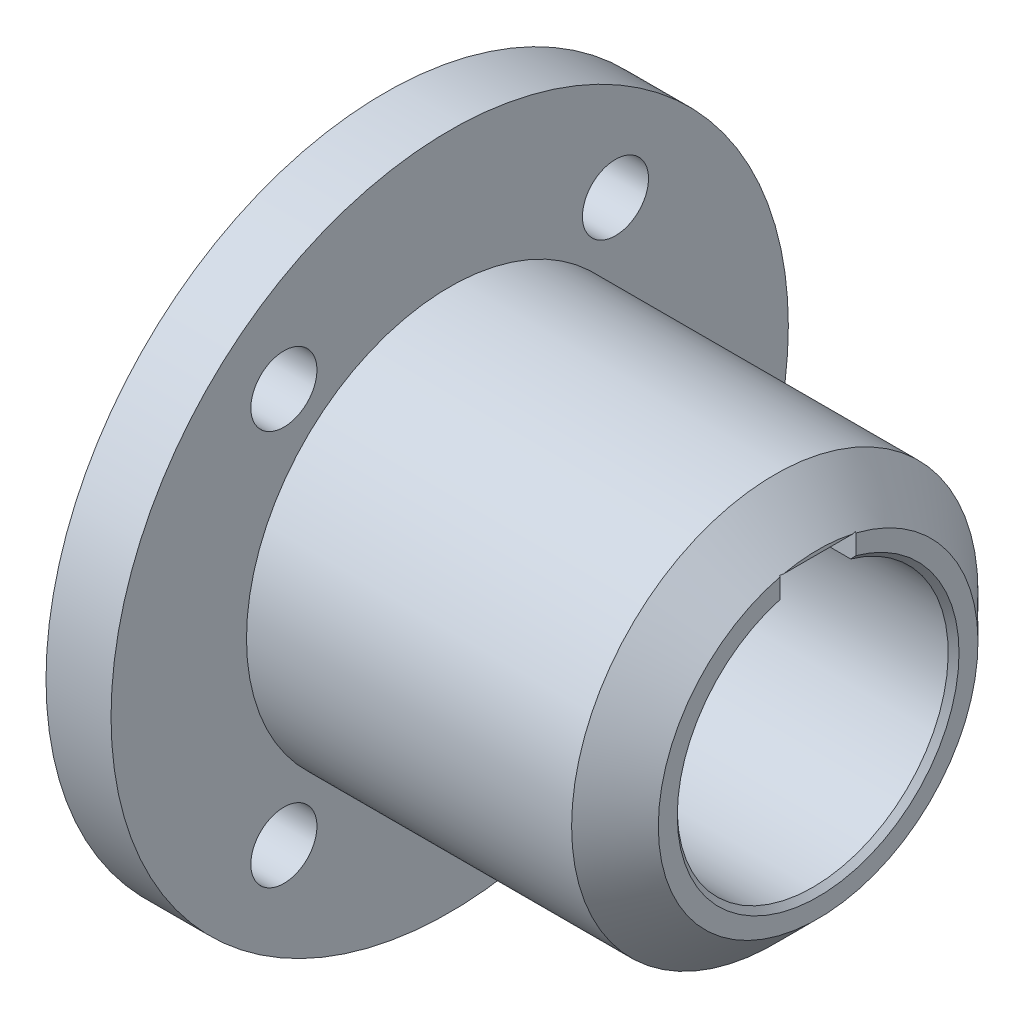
ISO-10303-21;
HEADER;
FILE_DESCRIPTION(('STEP AP214'),'2;1');
FILE_NAME('part.step','',(''),(''),'','','');
FILE_SCHEMA(('AUTOMOTIVE_DESIGN { 1 0 10303 214 1 1 1 1 }'));
ENDSEC;
DATA;
#1=APPLICATION_CONTEXT('core data for automotive mechanical design processes');
#2=APPLICATION_PROTOCOL_DEFINITION('international standard','automotive_design',2000,#1);
#3=PRODUCT_CONTEXT('',#1,'mechanical');
#4=PRODUCT('Part','Part','',(#3));
#5=PRODUCT_RELATED_PRODUCT_CATEGORY('part','',(#4));
#6=PRODUCT_DEFINITION_FORMATION('','',#4);
#7=PRODUCT_DEFINITION_CONTEXT('part definition',#1,'design');
#8=PRODUCT_DEFINITION('design','',#6,#7);
#9=PRODUCT_DEFINITION_SHAPE('','',#8);
#10=(LENGTH_UNIT() NAMED_UNIT(*) SI_UNIT(.MILLI.,.METRE.));
#11=(NAMED_UNIT(*) PLANE_ANGLE_UNIT() SI_UNIT($,.RADIAN.));
#12=(NAMED_UNIT(*) SI_UNIT($,.STERADIAN.) SOLID_ANGLE_UNIT());
#13=UNCERTAINTY_MEASURE_WITH_UNIT(LENGTH_MEASURE(1.E-05),#10,'distance_accuracy_value','');
#14=(GEOMETRIC_REPRESENTATION_CONTEXT(3) GLOBAL_UNCERTAINTY_ASSIGNED_CONTEXT((#13)) GLOBAL_UNIT_ASSIGNED_CONTEXT((#10,
#11,#12)) REPRESENTATION_CONTEXT('',''));
#15=CARTESIAN_POINT('',(0.,0.,0.));
#16=DIRECTION('',(0.,0.,1.));
#17=DIRECTION('',(1.,0.,0.));
#18=AXIS2_PLACEMENT_3D('',#15,#16,#17);
#19=CARTESIAN_POINT('',(0.,34.925,0.));
#20=DIRECTION('',(1.,0.,0.));
#21=DIRECTION('',(0.,0.,-1.));
#22=AXIS2_PLACEMENT_3D('',#19,#20,#21);
#23=PLANE('',#22);
#24=CARTESIAN_POINT('',(0.,36.4637154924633,-30.5966902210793));
#25=DIRECTION('',(1.,0.,0.));
#26=DIRECTION('',(0.,0.,-1.));
#27=AXIS2_PLACEMENT_3D('',#24,#25,#26);
#28=CIRCLE('',#27,6.1);
#29=CARTESIAN_POINT('',(0.,36.4637154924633,-36.6966902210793));
#30=VERTEX_POINT('',#29);
#31=EDGE_CURVE('E150',#30,#30,#28,.T.);
#32=ORIENTED_EDGE('',*,*,#31,.T.);
#33=EDGE_LOOP('',(#32));
#34=FACE_BOUND('',#33,.T.);
#35=CARTESIAN_POINT('',(0.,-36.4637154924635,30.5966902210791));
#36=DIRECTION('',(-1.,0.,0.));
#37=DIRECTION('',(0.,0.,1.));
#38=AXIS2_PLACEMENT_3D('',#35,#36,#37);
#39=CIRCLE('',#38,6.1);
#40=CARTESIAN_POINT('',(0.,-36.4637154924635,36.6966902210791));
#41=VERTEX_POINT('',#40);
#42=EDGE_CURVE('E147',#41,#41,#39,.T.);
#43=ORIENTED_EDGE('',*,*,#42,.F.);
#44=EDGE_LOOP('',(#43));
#45=FACE_BOUND('',#44,.T.);
#46=CARTESIAN_POINT('',(0.,36.4637154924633,30.5966902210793));
#47=DIRECTION('',(-1.,0.,0.));
#48=DIRECTION('',(0.,0.,1.));
#49=AXIS2_PLACEMENT_3D('',#46,#47,#48);
#50=CIRCLE('',#49,6.1);
#51=CARTESIAN_POINT('',(0.,36.4637154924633,36.6966902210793));
#52=VERTEX_POINT('',#51);
#53=EDGE_CURVE('E144',#52,#52,#50,.T.);
#54=ORIENTED_EDGE('',*,*,#53,.F.);
#55=EDGE_LOOP('',(#54));
#56=FACE_BOUND('',#55,.T.);
#57=CARTESIAN_POINT('',(0.,0.,0.));
#58=DIRECTION('',(-1.,0.,0.));
#59=DIRECTION('',(0.,0.,1.));
#60=AXIS2_PLACEMENT_3D('',#57,#58,#59);
#61=CIRCLE('',#60,34.925);
#62=CARTESIAN_POINT('',(0.,0.,34.925));
#63=VERTEX_POINT('',#62);
#64=EDGE_CURVE('E213',#63,#63,#61,.T.);
#65=ORIENTED_EDGE('',*,*,#64,.F.);
#66=EDGE_LOOP('',(#65));
#67=FACE_BOUND('',#66,.T.);
#68=CARTESIAN_POINT('',(0.,0.,0.));
#69=DIRECTION('',(-1.,0.,0.));
#70=DIRECTION('',(0.,0.,1.));
#71=AXIS2_PLACEMENT_3D('',#68,#69,#70);
#72=CIRCLE('',#71,62.5);
#73=CARTESIAN_POINT('',(0.,0.,62.5));
#74=VERTEX_POINT('',#73);
#75=EDGE_CURVE('E133',#74,#74,#72,.T.);
#76=ORIENTED_EDGE('',*,*,#75,.T.);
#77=EDGE_LOOP('',(#76));
#78=FACE_BOUND('',#77,.T.);
#79=CARTESIAN_POINT('',(0.,-36.4637154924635,-30.5966902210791));
#80=DIRECTION('',(1.,0.,0.));
#81=DIRECTION('',(0.,0.,-1.));
#82=AXIS2_PLACEMENT_3D('',#79,#80,#81);
#83=CIRCLE('',#82,6.1);
#84=CARTESIAN_POINT('',(0.,-36.4637154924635,-36.6966902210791));
#85=VERTEX_POINT('',#84);
#86=EDGE_CURVE('E160',#85,#85,#83,.T.);
#87=ORIENTED_EDGE('',*,*,#86,.T.);
#88=EDGE_LOOP('',(#87));
#89=FACE_BOUND('',#88,.T.);
#90=ADVANCED_FACE('F33',(#34,#45,#56,#67,#78,#89),#23,.F.);
#91=CARTESIAN_POINT('',(12.,62.5,0.));
#92=DIRECTION('',(-1.,0.,0.));
#93=DIRECTION('',(0.,0.,1.));
#94=AXIS2_PLACEMENT_3D('',#91,#92,#93);
#95=PLANE('',#94);
#96=CARTESIAN_POINT('',(12.,36.4637154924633,-30.5966902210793));
#97=DIRECTION('',(-1.,0.,0.));
#98=DIRECTION('',(0.,0.,1.));
#99=AXIS2_PLACEMENT_3D('',#96,#97,#98);
#100=CIRCLE('',#99,6.1);
#101=CARTESIAN_POINT('',(12.,36.4637154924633,-24.4966902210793));
#102=VERTEX_POINT('',#101);
#103=EDGE_CURVE('E148',#102,#102,#100,.F.);
#104=ORIENTED_EDGE('',*,*,#103,.F.);
#105=EDGE_LOOP('',(#104));
#106=FACE_BOUND('',#105,.T.);
#107=CARTESIAN_POINT('',(12.,-36.4637154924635,30.5966902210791));
#108=DIRECTION('',(-1.,0.,0.));
#109=DIRECTION('',(0.,0.,1.));
#110=AXIS2_PLACEMENT_3D('',#107,#108,#109);
#111=CIRCLE('',#110,6.1);
#112=CARTESIAN_POINT('',(12.,-36.4637154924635,36.6966902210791));
#113=VERTEX_POINT('',#112);
#114=EDGE_CURVE('E145',#113,#113,#111,.T.);
#115=ORIENTED_EDGE('',*,*,#114,.T.);
#116=EDGE_LOOP('',(#115));
#117=FACE_BOUND('',#116,.T.);
#118=CARTESIAN_POINT('',(12.,36.4637154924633,30.5966902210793));
#119=DIRECTION('',(-1.,0.,0.));
#120=DIRECTION('',(0.,0.,1.));
#121=AXIS2_PLACEMENT_3D('',#118,#119,#120);
#122=CIRCLE('',#121,6.1);
#123=CARTESIAN_POINT('',(12.,36.4637154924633,36.6966902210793));
#124=VERTEX_POINT('',#123);
#125=EDGE_CURVE('E141',#124,#124,#122,.T.);
#126=ORIENTED_EDGE('',*,*,#125,.T.);
#127=EDGE_LOOP('',(#126));
#128=FACE_BOUND('',#127,.T.);
#129=CARTESIAN_POINT('',(12.,0.,0.));
#130=DIRECTION('',(-1.,0.,0.));
#131=DIRECTION('',(0.,0.,1.));
#132=AXIS2_PLACEMENT_3D('',#129,#130,#131);
#133=CIRCLE('',#132,62.5);
#134=CARTESIAN_POINT('',(12.,0.,62.5));
#135=VERTEX_POINT('',#134);
#136=EDGE_CURVE('E130',#135,#135,#133,.T.);
#137=ORIENTED_EDGE('',*,*,#136,.F.);
#138=EDGE_LOOP('',(#137));
#139=FACE_BOUND('',#138,.T.);
#140=CARTESIAN_POINT('',(12.,0.,0.));
#141=DIRECTION('',(-1.,0.,0.));
#142=DIRECTION('',(0.,0.,1.));
#143=AXIS2_PLACEMENT_3D('',#140,#141,#142);
#144=CIRCLE('',#143,37.5);
#145=CARTESIAN_POINT('',(12.,0.,37.5));
#146=VERTEX_POINT('',#145);
#147=EDGE_CURVE('E127',#146,#146,#144,.T.);
#148=ORIENTED_EDGE('',*,*,#147,.T.);
#149=EDGE_LOOP('',(#148));
#150=FACE_BOUND('',#149,.T.);
#151=CARTESIAN_POINT('',(12.,-36.4637154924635,-30.5966902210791));
#152=DIRECTION('',(-1.,0.,0.));
#153=DIRECTION('',(0.,0.,1.));
#154=AXIS2_PLACEMENT_3D('',#151,#152,#153);
#155=CIRCLE('',#154,6.1);
#156=CARTESIAN_POINT('',(12.,-36.4637154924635,-24.4966902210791));
#157=VERTEX_POINT('',#156);
#158=EDGE_CURVE('E36',#157,#157,#155,.F.);
#159=ORIENTED_EDGE('',*,*,#158,.F.);
#160=EDGE_LOOP('',(#159));
#161=FACE_BOUND('',#160,.T.);
#162=ADVANCED_FACE('F263',(#106,#117,#128,#139,#150,#161),#95,.F.);
#163=CARTESIAN_POINT('',(80.,29.5,0.));
#164=DIRECTION('',(-1.,0.,0.));
#165=DIRECTION('',(0.,0.,1.));
#166=AXIS2_PLACEMENT_3D('',#163,#164,#165);
#167=PLANE('',#166);
#168=CARTESIAN_POINT('',(80.,0.,0.));
#169=DIRECTION('',(-1.,0.,0.));
#170=DIRECTION('',(0.,0.,1.));
#171=AXIS2_PLACEMENT_3D('',#168,#169,#170);
#172=CIRCLE('',#171,26.);
#173=CARTESIAN_POINT('',(80.,25.0399680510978,-7.));
#174=VERTEX_POINT('',#173);
#175=CARTESIAN_POINT('',(80.,25.0399680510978,7.));
#176=VERTEX_POINT('',#175);
#177=EDGE_CURVE('E109',#174,#176,#172,.T.);
#178=ORIENTED_EDGE('',*,*,#177,.T.);
#179=DIRECTION('',(0.,-1.,0.));
#180=VECTOR('',#179,1.);
#181=CARTESIAN_POINT('',(80.,28.8,7.));
#182=LINE('',#181,#180);
#183=CARTESIAN_POINT('',(80.,28.6574597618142,7.));
#184=VERTEX_POINT('',#183);
#185=EDGE_CURVE('E113',#184,#176,#182,.T.);
#186=ORIENTED_EDGE('',*,*,#185,.F.);
#187=CARTESIAN_POINT('',(80.,0.,0.));
#188=DIRECTION('',(-1.,0.,0.));
#189=DIRECTION('',(0.,0.,1.));
#190=AXIS2_PLACEMENT_3D('',#187,#188,#189);
#191=CIRCLE('',#190,29.5);
#192=CARTESIAN_POINT('',(80.,28.6574597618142,-7.));
#193=VERTEX_POINT('',#192);
#194=EDGE_CURVE('E111',#193,#184,#191,.T.);
#195=ORIENTED_EDGE('',*,*,#194,.F.);
#196=DIRECTION('',(0.,1.,0.));
#197=VECTOR('',#196,1.);
#198=CARTESIAN_POINT('',(80.,28.8,-7.));
#199=LINE('',#198,#197);
#200=EDGE_CURVE('E94',#174,#193,#199,.T.);
#201=ORIENTED_EDGE('',*,*,#200,.F.);
#202=EDGE_LOOP('',(#178,#186,#195,#201));
#203=FACE_BOUND('',#202,.T.);
#204=ADVANCED_FACE('F107',(#203),#167,.F.);
#205=CARTESIAN_POINT('',(0.,0.,0.));
#206=DIRECTION('',(-1.,0.,0.));
#207=DIRECTION('',(0.,0.,1.));
#208=AXIS2_PLACEMENT_3D('',#205,#206,#207);
#209=CYLINDRICAL_SURFACE('',#208,62.5);
#210=ORIENTED_EDGE('',*,*,#75,.F.);
#211=EDGE_LOOP('',(#210));
#212=FACE_BOUND('',#211,.T.);
#213=ORIENTED_EDGE('',*,*,#136,.T.);
#214=EDGE_LOOP('',(#213));
#215=FACE_BOUND('',#214,.T.);
#216=ADVANCED_FACE('F281',(#212,#215),#209,.T.);
#217=CARTESIAN_POINT('',(0.,0.,0.));
#218=DIRECTION('',(-1.,0.,0.));
#219=DIRECTION('',(0.,0.,1.));
#220=AXIS2_PLACEMENT_3D('',#217,#218,#219);
#221=CYLINDRICAL_SURFACE('',#220,37.5);
#222=ORIENTED_EDGE('',*,*,#147,.F.);
#223=EDGE_LOOP('',(#222));
#224=FACE_BOUND('',#223,.T.);
#225=CARTESIAN_POINT('',(72.,0.,0.));
#226=DIRECTION('',(-1.,0.,0.));
#227=DIRECTION('',(0.,0.,1.));
#228=AXIS2_PLACEMENT_3D('',#225,#226,#227);
#229=CIRCLE('',#228,37.5);
#230=CARTESIAN_POINT('',(72.,0.,37.5));
#231=VERTEX_POINT('',#230);
#232=EDGE_CURVE('E124',#231,#231,#229,.T.);
#233=ORIENTED_EDGE('',*,*,#232,.T.);
#234=EDGE_LOOP('',(#233));
#235=FACE_BOUND('',#234,.T.);
#236=ADVANCED_FACE('F220',(#224,#235),#221,.T.);
#237=CARTESIAN_POINT('',(80.,0.,0.));
#238=DIRECTION('',(-1.,0.,0.));
#239=DIRECTION('',(0.,0.,1.));
#240=AXIS2_PLACEMENT_3D('',#237,#238,#239);
#241=CONICAL_SURFACE('',#240,29.5,0.785398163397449);
#242=ORIENTED_EDGE('',*,*,#232,.F.);
#243=EDGE_LOOP('',(#242));
#244=FACE_BOUND('',#243,.T.);
#245=ORIENTED_EDGE('',*,*,#194,.T.);
#246=CARTESIAN_POINT('',(98.3981567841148,8.61689751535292,7.));
#247=CARTESIAN_POINT('',(98.231516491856,8.83156109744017,7.));
#248=CARTESIAN_POINT('',(98.0633675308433,9.04504458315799,7.));
#249=CARTESIAN_POINT('',(97.7244753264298,9.46992879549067,7.));
#250=CARTESIAN_POINT('',(97.553732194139,9.68132961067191,7.));
#251=CARTESIAN_POINT('',(97.210088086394,10.1023102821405,7.));
#252=CARTESIAN_POINT('',(97.0371874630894,10.311890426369,7.));
#253=CARTESIAN_POINT('',(96.689510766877,10.7294921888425,7.));
#254=CARTESIAN_POINT('',(96.5147346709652,10.9375137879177,7.));
#255=CARTESIAN_POINT('',(95.9881431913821,11.5593696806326,7.));
#256=CARTESIAN_POINT('',(95.6339227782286,11.971167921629,7.));
#257=CARTESIAN_POINT('',(94.9206318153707,12.7905639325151,7.));
#258=CARTESIAN_POINT('',(94.5615610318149,13.1981614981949,7.));
#259=CARTESIAN_POINT('',(93.8398865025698,14.0097677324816,7.));
#260=CARTESIAN_POINT('',(93.4772850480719,14.4137784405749,7.));
#261=CARTESIAN_POINT('',(92.7491258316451,15.2191111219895,7.));
#262=CARTESIAN_POINT('',(92.3835681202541,15.6204331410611,7.));
#263=CARTESIAN_POINT('',(91.6500255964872,16.4209396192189,7.));
#264=CARTESIAN_POINT('',(91.2820404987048,16.8201238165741,7.));
#265=CARTESIAN_POINT('',(90.5441226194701,17.6166900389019,7.));
#266=CARTESIAN_POINT('',(90.1741898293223,18.0140720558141,7.));
#267=CARTESIAN_POINT('',(89.3878383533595,18.8553450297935,7.));
#268=CARTESIAN_POINT('',(88.9712132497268,19.2990429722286,7.));
#269=CARTESIAN_POINT('',(88.1363057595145,20.1848773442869,7.));
#270=CARTESIAN_POINT('',(87.7180233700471,20.6270137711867,7.));
#271=CARTESIAN_POINT('',(86.4611670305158,21.9514400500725,7.));
#272=CARTESIAN_POINT('',(85.620546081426,22.8317872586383,7.));
#273=CARTESIAN_POINT('',(83.9351773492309,24.5890571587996,7.));
#274=CARTESIAN_POINT('',(83.09042833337,25.4659786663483,7.));
#275=CARTESIAN_POINT('',(81.3980674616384,27.2170744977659,7.));
#276=CARTESIAN_POINT('',(80.5504555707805,28.0912487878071,7.));
#277=CARTESIAN_POINT('',(78.8992763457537,29.7899619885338,7.));
#278=CARTESIAN_POINT('',(78.0958234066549,30.6146121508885,7.));
#279=CARTESIAN_POINT('',(76.4873939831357,32.2624256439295,7.));
#280=CARTESIAN_POINT('',(75.6824174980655,33.0855889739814,7.));
#281=CARTESIAN_POINT('',(73.2656818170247,35.5533006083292,7.));
#282=CARTESIAN_POINT('',(71.6521117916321,37.1960752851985,7.));
#283=CARTESIAN_POINT('',(68.4228807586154,40.4773230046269,7.));
#284=CARTESIAN_POINT('',(66.807221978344,42.1157982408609,7.));
#285=CARTESIAN_POINT('',(64.382031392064,44.571826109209,7.));
#286=CARTESIAN_POINT('',(63.5733516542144,45.3902203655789,7.));
#287=CARTESIAN_POINT('',(61.9555036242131,47.0265253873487,7.));
#288=CARTESIAN_POINT('',(61.1463353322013,47.8444361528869,7.));
#289=CARTESIAN_POINT('',(60.3369622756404,48.662144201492,7.));
#290=B_SPLINE_CURVE_WITH_KNOTS('',3,(#246,#247,#248,#249,#250,#251,#252,#253,#254,#255,#256,
#257,#258,#259,#260,#261,#262,#263,#264,#265,#266,#267,#268,#269,#270,#271,#272,#273,#274,#275,
#276,#277,#278,#279,#280,#281,#282,#283,#284,#285,#286,#287,#288,#289),.UNSPECIFIED.,.F.,.F.,(4,
2,2,2,2,2,2,2,2,2,2,2,2,2,2,2,2,2,2,2,2,4),(0.,0.815240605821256,1.6304463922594,
2.44552081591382,3.26060524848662,4.89010340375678,6.51968040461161,8.14826234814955,
9.77681650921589,11.4055656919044,13.0343221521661,14.8602409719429,16.6861629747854,
20.3378410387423,23.9906858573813,27.6435754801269,31.0975940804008,34.5516141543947,
41.4596345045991,48.362862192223,51.814468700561,55.266074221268),.UNSPECIFIED.);
#291=CARTESIAN_POINT('',(79.8615115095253,28.8,7.));
#292=VERTEX_POINT('',#291);
#293=EDGE_CURVE('E207',#184,#292,#290,.T.);
#294=ORIENTED_EDGE('',*,*,#293,.T.);
#295=CARTESIAN_POINT('',(76.2209885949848,28.8,16.6749092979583));
#296=CARTESIAN_POINT('',(76.5081197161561,28.8,16.1017663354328));
#297=CARTESIAN_POINT('',(76.7865129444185,28.8,15.5241277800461));
#298=CARTESIAN_POINT('',(77.323037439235,28.8,14.359152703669));
#299=CARTESIAN_POINT('',(77.5811575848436,28.8,13.7718110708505));
#300=CARTESIAN_POINT('',(78.0754532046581,28.8,12.5839276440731));
#301=CARTESIAN_POINT('',(78.3114933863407,28.8,11.9833292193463));
#302=CARTESIAN_POINT('',(78.75648220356,28.8,10.7722337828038));
#303=CARTESIAN_POINT('',(78.9654349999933,28.8,10.1617383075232));
#304=CARTESIAN_POINT('',(79.3495929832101,28.8,8.94077244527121));
#305=CARTESIAN_POINT('',(79.5252797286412,28.8,8.33045442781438));
#306=CARTESIAN_POINT('',(79.8434068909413,28.8,7.10112149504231));
#307=CARTESIAN_POINT('',(79.9858456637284,28.8,6.48210615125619));
#308=CARTESIAN_POINT('',(80.2338363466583,28.8,5.23820891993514));
#309=CARTESIAN_POINT('',(80.3394748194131,28.8,4.61334439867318));
#310=CARTESIAN_POINT('',(80.51152280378,28.8,3.35826005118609));
#311=CARTESIAN_POINT('',(80.5779382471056,28.8,2.72804104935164));
#312=CARTESIAN_POINT('',(80.6565369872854,28.8,1.6455363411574));
#313=CARTESIAN_POINT('',(80.6788025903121,28.8,1.19396099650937));
#314=CARTESIAN_POINT('',(80.7020778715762,28.8,0.290268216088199));
#315=CARTESIAN_POINT('',(80.7030885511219,28.8,-0.161849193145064));
#316=CARTESIAN_POINT('',(80.6838305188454,28.8,-1.06578849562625));
#317=CARTESIAN_POINT('',(80.663554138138,28.8,-1.5176102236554));
#318=CARTESIAN_POINT('',(80.6020246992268,28.8,-2.41982383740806));
#319=CARTESIAN_POINT('',(80.560771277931,28.8,-2.87021569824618));
#320=CARTESIAN_POINT('',(80.457844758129,28.8,-3.76912813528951));
#321=CARTESIAN_POINT('',(80.3961506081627,28.8,-4.21764629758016));
#322=CARTESIAN_POINT('',(80.253233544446,28.8,-5.11157498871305));
#323=CARTESIAN_POINT('',(80.172008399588,28.8,-5.55698515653));
#324=CARTESIAN_POINT('',(79.9006301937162,28.8,-6.88734451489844));
#325=CARTESIAN_POINT('',(79.6827346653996,28.8,-7.76675739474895));
#326=CARTESIAN_POINT('',(79.233077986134,28.8,-9.33227767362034));
#327=CARTESIAN_POINT('',(79.0128562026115,28.8,-10.0217904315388));
#328=CARTESIAN_POINT('',(78.5367147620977,28.8,-11.3883760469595));
#329=CARTESIAN_POINT('',(78.2807937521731,28.8,-12.0654484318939));
#330=CARTESIAN_POINT('',(77.7390084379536,28.8,-13.4050309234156));
#331=CARTESIAN_POINT('',(77.4532378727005,28.8,-14.0675791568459));
#332=CARTESIAN_POINT('',(77.0050298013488,28.8,-15.0521880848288));
#333=CARTESIAN_POINT('',(76.8524128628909,28.8,-15.3787673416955));
#334=CARTESIAN_POINT('',(76.5411252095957,28.8,-16.0289999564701));
#335=CARTESIAN_POINT('',(76.3824549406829,28.8,-16.3526535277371));
#336=CARTESIAN_POINT('',(76.2209885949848,28.8,-16.6749092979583));
#337=B_SPLINE_CURVE_WITH_KNOTS('',3,(#295,#296,#297,#298,#299,#300,#301,#302,#303,#304,#305,
#306,#307,#308,#309,#310,#311,#312,#313,#314,#315,#316,#317,#318,#319,#320,#321,#322,#323,#324,
#325,#326,#327,#328,#329,#330,#331,#332,#333,#334,#335,#336),.UNSPECIFIED.,.F.,.F.,(4,2,2,2,2,2,
2,2,2,2,2,2,2,2,2,2,2,2,2,2,4),(0.,1.92321347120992,3.84747467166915,5.78284489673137,
7.71791747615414,9.6223795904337,11.5269358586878,13.4269814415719,15.3267396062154,
16.6826482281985,18.0384929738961,19.394826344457,20.7511831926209,22.1089412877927,
23.4668545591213,26.1816728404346,28.3521739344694,30.5227573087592,32.6867182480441,
33.7681067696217,34.8494157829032),.UNSPECIFIED.);
#338=CARTESIAN_POINT('',(80.,28.8,6.38827050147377));
#339=VERTEX_POINT('',#338);
#340=EDGE_CURVE('E230',#292,#339,#337,.T.);
#341=ORIENTED_EDGE('',*,*,#340,.T.);
#342=CARTESIAN_POINT('',(80.,28.8,-6.38827050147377));
#343=VERTEX_POINT('',#342);
#344=EDGE_CURVE('E118',#339,#343,#191,.T.);
#345=ORIENTED_EDGE('',*,*,#344,.T.);
#346=CARTESIAN_POINT('',(79.8615115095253,28.8,-7.));
#347=VERTEX_POINT('',#346);
#348=EDGE_CURVE('E225',#343,#347,#337,.T.);
#349=ORIENTED_EDGE('',*,*,#348,.T.);
#350=CARTESIAN_POINT('',(60.3369622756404,48.6621442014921,-7.));
#351=CARTESIAN_POINT('',(61.1467616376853,47.8440054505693,-7.));
#352=CARTESIAN_POINT('',(61.9563560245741,47.0256637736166,-7.));
#353=CARTESIAN_POINT('',(63.5750553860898,45.3884966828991,-7.));
#354=CARTESIAN_POINT('',(64.3841603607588,44.5696712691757,-7.));
#355=CARTESIAN_POINT('',(66.8105194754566,42.1124563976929,-7.));
#356=CARTESIAN_POINT('',(68.426920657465,40.4732244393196,-7.));
#357=CARTESIAN_POINT('',(71.6560424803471,37.1920748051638,-7.));
#358=CARTESIAN_POINT('',(73.2687640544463,35.5501580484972,-7.));
#359=CARTESIAN_POINT('',(75.6842778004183,33.0836871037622,-7.));
#360=CARTESIAN_POINT('',(76.4888793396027,32.2609050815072,-7.));
#361=CARTESIAN_POINT('',(78.0965636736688,30.613852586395,-7.));
#362=CARTESIAN_POINT('',(78.8996464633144,29.7895821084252,-7.));
#363=CARTESIAN_POINT('',(80.504305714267,28.1387263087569,-7.));
#364=CARTESIAN_POINT('',(81.3058811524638,27.3121399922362,-7.));
#365=CARTESIAN_POINT('',(82.9065116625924,25.6565479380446,-7.));
#366=CARTESIAN_POINT('',(83.705566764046,24.8275422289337,-7.));
#367=CARTESIAN_POINT('',(85.3001994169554,23.1664513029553,-7.));
#368=CARTESIAN_POINT('',(86.0957775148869,22.3343666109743,-7.));
#369=CARTESIAN_POINT('',(87.6823890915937,20.665798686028,-7.));
#370=CARTESIAN_POINT('',(88.4734223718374,19.8293152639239,-7.));
#371=CARTESIAN_POINT('',(89.6552619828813,18.5697204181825,-7.));
#372=CARTESIAN_POINT('',(90.0485347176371,18.1489234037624,-7.));
#373=CARTESIAN_POINT('',(90.8330602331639,17.3054529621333,-7.));
#374=CARTESIAN_POINT('',(91.2243130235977,16.8827795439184,-7.));
#375=CARTESIAN_POINT('',(92.0042858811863,16.0351963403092,-7.));
#376=CARTESIAN_POINT('',(92.3930062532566,15.6102868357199,-7.));
#377=CARTESIAN_POINT('',(93.1673415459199,14.7576294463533,-7.));
#378=CARTESIAN_POINT('',(93.5529564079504,14.3298815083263,-7.));
#379=CARTESIAN_POINT('',(94.3204452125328,13.4705704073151,-7.));
#380=CARTESIAN_POINT('',(94.7023167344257,13.0390050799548,-7.));
#381=CARTESIAN_POINT('',(95.460861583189,12.1713555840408,-7.));
#382=CARTESIAN_POINT('',(95.8375351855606,11.7352716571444,-7.));
#383=CARTESIAN_POINT('',(96.3974031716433,11.0766123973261,-7.));
#384=CARTESIAN_POINT('',(96.5832082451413,10.8562557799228,-7.));
#385=CARTESIAN_POINT('',(96.9527658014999,10.4138316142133,-7.));
#386=CARTESIAN_POINT('',(97.1365183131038,10.1917640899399,-7.));
#387=CARTESIAN_POINT('',(97.5016460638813,9.74561374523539,-7.));
#388=CARTESIAN_POINT('',(97.6830208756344,9.52153057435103,-7.));
#389=CARTESIAN_POINT('',(98.0428806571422,9.07103943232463,-7.));
#390=CARTESIAN_POINT('',(98.2213654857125,8.84463134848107,-7.));
#391=CARTESIAN_POINT('',(98.3981567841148,8.61689751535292,-7.));
#392=B_SPLINE_CURVE_WITH_KNOTS('',3,(#350,#351,#352,#353,#354,#355,#356,#357,#358,#359,#360,
#361,#362,#363,#364,#365,#366,#367,#368,#369,#370,#371,#372,#373,#374,#375,#376,#377,#378,#379,
#380,#381,#382,#383,#384,#385,#386,#387,#388,#389,#390,#391),.UNSPECIFIED.,.F.,.F.,(4,2,2,2,2,2,
2,2,2,2,2,2,2,2,2,2,2,2,2,2,4),(0.,3.45342353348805,6.9068467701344,13.813254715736,
20.7176552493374,24.1700710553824,27.622498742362,31.0767550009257,34.5309706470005,
37.9846223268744,41.4384237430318,43.1663081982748,44.8941843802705,46.6218485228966,
48.3495451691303,50.0782937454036,51.806950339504,52.6716513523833,53.5363402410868,
54.4011824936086,55.2660668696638),.UNSPECIFIED.);
#393=EDGE_CURVE('E102',#347,#193,#392,.T.);
#394=ORIENTED_EDGE('',*,*,#393,.T.);
#395=EDGE_LOOP('',(#245,#294,#341,#345,#349,#394));
#396=FACE_BOUND('',#395,.T.);
#397=ADVANCED_FACE('F215',(#244,#396),#241,.T.);
#398=ORIENTED_EDGE('',*,*,#344,.F.);
#399=DIRECTION('',(0.,0.,1.));
#400=VECTOR('',#399,1.);
#401=CARTESIAN_POINT('',(80.,28.8,7.));
#402=LINE('',#401,#400);
#403=EDGE_CURVE('E112',#343,#339,#402,.T.);
#404=ORIENTED_EDGE('',*,*,#403,.F.);
#405=EDGE_LOOP('',(#398,#404));
#406=FACE_BOUND('',#405,.T.);
#407=ADVANCED_FACE('F219',(#406),#167,.F.);
#408=CARTESIAN_POINT('',(79.,0.,0.));
#409=DIRECTION('',(1.,0.,0.));
#410=DIRECTION('',(0.,0.,-1.));
#411=AXIS2_PLACEMENT_3D('',#408,#409,#410);
#412=CONICAL_SURFACE('',#411,25.,0.785398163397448);
#413=CARTESIAN_POINT('',(79.,0.,0.));
#414=DIRECTION('',(-1.,0.,0.));
#415=DIRECTION('',(0.,0.,1.));
#416=AXIS2_PLACEMENT_3D('',#413,#414,#415);
#417=CIRCLE('',#416,25.);
#418=CARTESIAN_POINT('',(79.,24.,-7.));
#419=VERTEX_POINT('',#418);
#420=CARTESIAN_POINT('',(79.,24.,7.));
#421=VERTEX_POINT('',#420);
#422=EDGE_CURVE('E116',#419,#421,#417,.T.);
#423=ORIENTED_EDGE('',*,*,#422,.T.);
#424=CARTESIAN_POINT('',(68.3611337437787,12.5396236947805,7.));
#425=CARTESIAN_POINT('',(68.5887761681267,12.800314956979,7.));
#426=CARTESIAN_POINT('',(68.8173554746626,13.0601850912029,7.));
#427=CARTESIAN_POINT('',(69.276140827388,13.5784807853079,7.));
#428=CARTESIAN_POINT('',(69.5063468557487,13.8369063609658,7.));
#429=CARTESIAN_POINT('',(69.9681338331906,14.3525053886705,7.));
#430=CARTESIAN_POINT('',(70.1997147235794,14.6096788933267,7.));
#431=CARTESIAN_POINT('',(70.6640758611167,15.1229417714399,7.));
#432=CARTESIAN_POINT('',(70.8968561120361,15.3790311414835,7.));
#433=CARTESIAN_POINT('',(71.5966994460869,16.1458225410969,7.));
#434=CARTESIAN_POINT('',(72.0653172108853,16.6551058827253,7.));
#435=CARTESIAN_POINT('',(73.005737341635,17.6707311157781,7.));
#436=CARTESIAN_POINT('',(73.4775397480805,18.1770729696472,7.));
#437=CARTESIAN_POINT('',(74.423570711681,19.1873300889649,7.));
#438=CARTESIAN_POINT('',(74.8977988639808,19.6912457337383,7.));
#439=CARTESIAN_POINT('',(75.8482548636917,20.6971821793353,7.));
#440=CARTESIAN_POINT('',(76.3244827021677,21.1992029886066,7.));
#441=CARTESIAN_POINT('',(77.2785810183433,22.2017119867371,7.));
#442=CARTESIAN_POINT('',(77.7564515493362,22.7022001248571,7.));
#443=CARTESIAN_POINT('',(78.7135358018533,23.7018910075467,7.));
#444=CARTESIAN_POINT('',(79.1927495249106,24.2010937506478,7.));
#445=CARTESIAN_POINT('',(80.6318856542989,25.6969187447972,7.));
#446=CARTESIAN_POINT('',(81.5934746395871,26.6919377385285,7.));
#447=CARTESIAN_POINT('',(83.0382314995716,28.1821487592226,7.));
#448=CARTESIAN_POINT('',(83.5202094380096,28.6784961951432,7.));
#449=CARTESIAN_POINT('',(84.4848552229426,29.6705208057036,7.));
#450=CARTESIAN_POINT('',(84.9675230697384,30.1661979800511,7.));
#451=CARTESIAN_POINT('',(86.4165451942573,31.6525092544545,7.));
#452=CARTESIAN_POINT('',(87.3837819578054,32.6422828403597,7.));
#453=CARTESIAN_POINT('',(89.3200784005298,34.6200426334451,7.));
#454=CARTESIAN_POINT('',(90.2891380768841,35.6080288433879,7.));
#455=CARTESIAN_POINT('',(91.2588456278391,36.5953764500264,7.));
#456=B_SPLINE_CURVE_WITH_KNOTS('',3,(#424,#425,#426,#427,#428,#429,#430,#431,#432,#433,#434,
#435,#436,#437,#438,#439,#440,#441,#442,#443,#444,#445,#446,#447,#448,#449,#450,#451,#452,#453,
#454,#455),.UNSPECIFIED.,.F.,.F.,(4,2,2,2,2,2,2,2,2,2,2,2,2,2,2,4),(0.,1.03827624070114,
2.07654111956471,3.11476198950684,4.15298612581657,6.22920046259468,8.30544124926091,
10.3813461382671,12.457241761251,14.5332053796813,16.609171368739,20.7603572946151,
22.8359223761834,24.9114883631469,29.0632066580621,33.2149185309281),.UNSPECIFIED.);
#457=EDGE_CURVE('E57',#421,#176,#456,.T.);
#458=ORIENTED_EDGE('',*,*,#457,.T.);
#459=ORIENTED_EDGE('',*,*,#177,.F.);
#460=CARTESIAN_POINT('',(91.2588456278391,36.5953764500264,-7.));
#461=CARTESIAN_POINT('',(90.2891380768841,35.608028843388,-7.));
#462=CARTESIAN_POINT('',(89.3200784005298,34.6200426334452,-7.));
#463=CARTESIAN_POINT('',(87.3837819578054,32.6422828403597,-7.));
#464=CARTESIAN_POINT('',(86.4165451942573,31.6525092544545,-7.));
#465=CARTESIAN_POINT('',(84.9675230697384,30.1661979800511,-7.));
#466=CARTESIAN_POINT('',(84.4848552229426,29.6705208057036,-7.));
#467=CARTESIAN_POINT('',(83.5202094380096,28.6784961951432,-7.));
#468=CARTESIAN_POINT('',(83.0382314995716,28.1821487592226,-7.));
#469=CARTESIAN_POINT('',(81.5934746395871,26.6919377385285,-7.));
#470=CARTESIAN_POINT('',(80.631885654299,25.6969187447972,-7.));
#471=CARTESIAN_POINT('',(79.1927495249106,24.2010937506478,-7.));
#472=CARTESIAN_POINT('',(78.7135358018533,23.7018910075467,-7.));
#473=CARTESIAN_POINT('',(77.7564515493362,22.7022001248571,-7.));
#474=CARTESIAN_POINT('',(77.2785810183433,22.2017119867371,-7.));
#475=CARTESIAN_POINT('',(76.3244827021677,21.1992029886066,-7.));
#476=CARTESIAN_POINT('',(75.8482548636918,20.6971821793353,-7.));
#477=CARTESIAN_POINT('',(74.8977988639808,19.6912457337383,-7.));
#478=CARTESIAN_POINT('',(74.423570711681,19.1873300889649,-7.));
#479=CARTESIAN_POINT('',(73.4775397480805,18.1770729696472,-7.));
#480=CARTESIAN_POINT('',(73.005737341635,17.6707311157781,-7.));
#481=CARTESIAN_POINT('',(72.0653172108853,16.6551058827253,-7.));
#482=CARTESIAN_POINT('',(71.5966994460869,16.1458225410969,-7.));
#483=CARTESIAN_POINT('',(70.8968561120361,15.3790311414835,-7.));
#484=CARTESIAN_POINT('',(70.6640758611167,15.1229417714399,-7.));
#485=CARTESIAN_POINT('',(70.1997147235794,14.6096788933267,-7.));
#486=CARTESIAN_POINT('',(69.9681338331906,14.3525053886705,-7.));
#487=CARTESIAN_POINT('',(69.5063468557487,13.8369063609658,-7.));
#488=CARTESIAN_POINT('',(69.276140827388,13.5784807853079,-7.));
#489=CARTESIAN_POINT('',(68.8173554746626,13.0601850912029,-7.));
#490=CARTESIAN_POINT('',(68.5887761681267,12.800314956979,-7.));
#491=CARTESIAN_POINT('',(68.3611337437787,12.5396236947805,-7.));
#492=B_SPLINE_CURVE_WITH_KNOTS('',3,(#460,#461,#462,#463,#464,#465,#466,#467,#468,#469,#470,
#471,#472,#473,#474,#475,#476,#477,#478,#479,#480,#481,#482,#483,#484,#485,#486,#487,#488,#489,
#490,#491),.UNSPECIFIED.,.F.,.F.,(4,2,2,2,2,2,2,2,2,2,2,2,2,2,2,4),(0.,4.15171187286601,
8.30343016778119,10.3789961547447,12.454561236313,16.6057471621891,18.6817131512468,
20.7576767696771,22.833572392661,24.9094772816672,26.9857180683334,29.0619324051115,
30.1001565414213,31.1383774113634,32.176642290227,33.2149185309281),.UNSPECIFIED.);
#493=EDGE_CURVE('E91',#174,#419,#492,.T.);
#494=ORIENTED_EDGE('',*,*,#493,.T.);
#495=EDGE_LOOP('',(#423,#458,#459,#494));
#496=FACE_BOUND('',#495,.T.);
#497=ADVANCED_FACE('F115',(#496),#412,.F.);
#498=CARTESIAN_POINT('',(0.,0.,0.));
#499=DIRECTION('',(-1.,0.,0.));
#500=DIRECTION('',(0.,0.,1.));
#501=AXIS2_PLACEMENT_3D('',#498,#499,#500);
#502=CYLINDRICAL_SURFACE('',#501,25.);
#503=CARTESIAN_POINT('',(18.,0.,0.));
#504=DIRECTION('',(-1.,0.,0.));
#505=DIRECTION('',(0.,0.,1.));
#506=AXIS2_PLACEMENT_3D('',#503,#504,#505);
#507=CIRCLE('',#506,25.);
#508=CARTESIAN_POINT('',(18.,24.,-7.));
#509=VERTEX_POINT('',#508);
#510=CARTESIAN_POINT('',(18.,24.,7.));
#511=VERTEX_POINT('',#510);
#512=EDGE_CURVE('E120',#509,#511,#507,.T.);
#513=ORIENTED_EDGE('',*,*,#512,.T.);
#514=DIRECTION('',(-1.,0.,0.));
#515=VECTOR('',#514,1.);
#516=CARTESIAN_POINT('',(0.,24.,7.));
#517=LINE('',#516,#515);
#518=EDGE_CURVE('E231',#511,#421,#517,.F.);
#519=ORIENTED_EDGE('',*,*,#518,.T.);
#520=ORIENTED_EDGE('',*,*,#422,.F.);
#521=DIRECTION('',(-1.,0.,0.));
#522=VECTOR('',#521,1.);
#523=CARTESIAN_POINT('',(0.,24.,-7.));
#524=LINE('',#523,#522);
#525=EDGE_CURVE('E97',#419,#509,#524,.T.);
#526=ORIENTED_EDGE('',*,*,#525,.T.);
#527=EDGE_LOOP('',(#513,#519,#520,#526));
#528=FACE_BOUND('',#527,.T.);
#529=ADVANCED_FACE('F246',(#528),#502,.F.);
#530=CARTESIAN_POINT('',(18.,25.,0.));
#531=DIRECTION('',(1.,0.,0.));
#532=DIRECTION('',(0.,0.,-1.));
#533=AXIS2_PLACEMENT_3D('',#530,#531,#532);
#534=PLANE('',#533);
#535=DIRECTION('',(0.,0.,1.));
#536=VECTOR('',#535,1.);
#537=CARTESIAN_POINT('',(18.,28.8,0.));
#538=LINE('',#537,#536);
#539=CARTESIAN_POINT('',(18.,28.8,-7.));
#540=VERTEX_POINT('',#539);
#541=CARTESIAN_POINT('',(18.,28.8,7.));
#542=VERTEX_POINT('',#541);
#543=EDGE_CURVE('E41',#540,#542,#538,.T.);
#544=ORIENTED_EDGE('',*,*,#543,.T.);
#545=DIRECTION('',(0.,-1.,0.));
#546=VECTOR('',#545,1.);
#547=CARTESIAN_POINT('',(18.,25.,7.));
#548=LINE('',#547,#546);
#549=EDGE_CURVE('E11',#542,#511,#548,.T.);
#550=ORIENTED_EDGE('',*,*,#549,.T.);
#551=ORIENTED_EDGE('',*,*,#512,.F.);
#552=DIRECTION('',(0.,1.,0.));
#553=VECTOR('',#552,1.);
#554=CARTESIAN_POINT('',(18.,25.,-7.));
#555=LINE('',#554,#553);
#556=EDGE_CURVE('E136',#509,#540,#555,.T.);
#557=ORIENTED_EDGE('',*,*,#556,.T.);
#558=EDGE_LOOP('',(#544,#550,#551,#557));
#559=FACE_BOUND('',#558,.T.);
#560=CARTESIAN_POINT('',(18.,0.,0.));
#561=DIRECTION('',(-1.,0.,0.));
#562=DIRECTION('',(0.,0.,1.));
#563=AXIS2_PLACEMENT_3D('',#560,#561,#562);
#564=CIRCLE('',#563,31.);
#565=CARTESIAN_POINT('',(18.,0.,31.));
#566=VERTEX_POINT('',#565);
#567=EDGE_CURVE('E247',#566,#566,#564,.T.);
#568=ORIENTED_EDGE('',*,*,#567,.T.);
#569=EDGE_LOOP('',(#568));
#570=FACE_BOUND('',#569,.T.);
#571=ADVANCED_FACE('F244',(#559,#570),#534,.F.);
#572=CARTESIAN_POINT('',(0.,0.,0.));
#573=DIRECTION('',(-1.,0.,0.));
#574=DIRECTION('',(0.,0.,1.));
#575=AXIS2_PLACEMENT_3D('',#572,#573,#574);
#576=CYLINDRICAL_SURFACE('',#575,31.);
#577=ORIENTED_EDGE('',*,*,#567,.F.);
#578=EDGE_LOOP('',(#577));
#579=FACE_BOUND('',#578,.T.);
#580=CARTESIAN_POINT('',(3.,0.,0.));
#581=DIRECTION('',(-1.,0.,0.));
#582=DIRECTION('',(0.,0.,1.));
#583=AXIS2_PLACEMENT_3D('',#580,#581,#582);
#584=CIRCLE('',#583,31.);
#585=CARTESIAN_POINT('',(3.,0.,31.));
#586=VERTEX_POINT('',#585);
#587=EDGE_CURVE('E249',#586,#586,#584,.T.);
#588=ORIENTED_EDGE('',*,*,#587,.T.);
#589=EDGE_LOOP('',(#588));
#590=FACE_BOUND('',#589,.T.);
#591=ADVANCED_FACE('F325',(#579,#590),#576,.F.);
#592=CARTESIAN_POINT('',(3.,31.,0.));
#593=DIRECTION('',(1.,0.,0.));
#594=DIRECTION('',(0.,0.,-1.));
#595=AXIS2_PLACEMENT_3D('',#592,#593,#594);
#596=PLANE('',#595);
#597=ORIENTED_EDGE('',*,*,#587,.F.);
#598=EDGE_LOOP('',(#597));
#599=FACE_BOUND('',#598,.T.);
#600=CARTESIAN_POINT('',(3.,0.,0.));
#601=DIRECTION('',(-1.,0.,0.));
#602=DIRECTION('',(0.,0.,1.));
#603=AXIS2_PLACEMENT_3D('',#600,#601,#602);
#604=CIRCLE('',#603,34.925);
#605=CARTESIAN_POINT('',(3.,0.,34.925));
#606=VERTEX_POINT('',#605);
#607=EDGE_CURVE('E253',#606,#606,#604,.T.);
#608=ORIENTED_EDGE('',*,*,#607,.T.);
#609=EDGE_LOOP('',(#608));
#610=FACE_BOUND('',#609,.T.);
#611=ADVANCED_FACE('F332',(#599,#610),#596,.F.);
#612=CARTESIAN_POINT('',(0.,0.,0.));
#613=DIRECTION('',(-1.,0.,0.));
#614=DIRECTION('',(0.,0.,1.));
#615=AXIS2_PLACEMENT_3D('',#612,#613,#614);
#616=CYLINDRICAL_SURFACE('',#615,34.925);
#617=ORIENTED_EDGE('',*,*,#607,.F.);
#618=EDGE_LOOP('',(#617));
#619=FACE_BOUND('',#618,.T.);
#620=ORIENTED_EDGE('',*,*,#64,.T.);
#621=EDGE_LOOP('',(#620));
#622=FACE_BOUND('',#621,.T.);
#623=ADVANCED_FACE('F198',(#619,#622),#616,.F.);
#624=CARTESIAN_POINT('',(0.,28.8,7.));
#625=DIRECTION('',(0.,0.,1.));
#626=DIRECTION('',(0.,-1.,0.));
#627=AXIS2_PLACEMENT_3D('',#624,#625,#626);
#628=PLANE('',#627);
#629=ORIENTED_EDGE('',*,*,#185,.T.);
#630=ORIENTED_EDGE('',*,*,#457,.F.);
#631=ORIENTED_EDGE('',*,*,#518,.F.);
#632=ORIENTED_EDGE('',*,*,#549,.F.);
#633=DIRECTION('',(1.,0.,0.));
#634=VECTOR('',#633,1.);
#635=CARTESIAN_POINT('',(0.,28.8,7.));
#636=LINE('',#635,#634);
#637=EDGE_CURVE('E167',#542,#292,#636,.T.);
#638=ORIENTED_EDGE('',*,*,#637,.T.);
#639=ORIENTED_EDGE('',*,*,#293,.F.);
#640=EDGE_LOOP('',(#629,#630,#631,#632,#638,#639));
#641=FACE_BOUND('',#640,.T.);
#642=ADVANCED_FACE('F193',(#641),#628,.F.);
#643=CARTESIAN_POINT('',(0.,28.8,7.));
#644=DIRECTION('',(0.,1.,0.));
#645=DIRECTION('',(0.,0.,1.));
#646=AXIS2_PLACEMENT_3D('',#643,#644,#645);
#647=PLANE('',#646);
#648=ORIENTED_EDGE('',*,*,#637,.F.);
#649=ORIENTED_EDGE('',*,*,#543,.F.);
#650=DIRECTION('',(1.,0.,0.));
#651=VECTOR('',#650,1.);
#652=CARTESIAN_POINT('',(0.,28.8,-7.));
#653=LINE('',#652,#651);
#654=EDGE_CURVE('E49',#540,#347,#653,.T.);
#655=ORIENTED_EDGE('',*,*,#654,.T.);
#656=ORIENTED_EDGE('',*,*,#348,.F.);
#657=ORIENTED_EDGE('',*,*,#403,.T.);
#658=ORIENTED_EDGE('',*,*,#340,.F.);
#659=EDGE_LOOP('',(#648,#649,#655,#656,#657,#658));
#660=FACE_BOUND('',#659,.T.);
#661=ADVANCED_FACE('F190',(#660),#647,.F.);
#662=CARTESIAN_POINT('',(0.,28.8,-7.));
#663=DIRECTION('',(0.,0.,-1.));
#664=DIRECTION('',(0.,1.,0.));
#665=AXIS2_PLACEMENT_3D('',#662,#663,#664);
#666=PLANE('',#665);
#667=ORIENTED_EDGE('',*,*,#654,.F.);
#668=ORIENTED_EDGE('',*,*,#556,.F.);
#669=ORIENTED_EDGE('',*,*,#525,.F.);
#670=ORIENTED_EDGE('',*,*,#493,.F.);
#671=ORIENTED_EDGE('',*,*,#200,.T.);
#672=ORIENTED_EDGE('',*,*,#393,.F.);
#673=EDGE_LOOP('',(#667,#668,#669,#670,#671,#672));
#674=FACE_BOUND('',#673,.T.);
#675=ADVANCED_FACE('F93',(#674),#666,.F.);
#676=CARTESIAN_POINT('',(80.,36.4637154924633,30.5966902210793));
#677=DIRECTION('',(-1.,0.,0.));
#678=DIRECTION('',(0.,0.,1.));
#679=AXIS2_PLACEMENT_3D('',#676,#677,#678);
#680=CYLINDRICAL_SURFACE('',#679,6.1);
#681=ORIENTED_EDGE('',*,*,#53,.T.);
#682=EDGE_LOOP('',(#681));
#683=FACE_BOUND('',#682,.T.);
#684=ORIENTED_EDGE('',*,*,#125,.F.);
#685=EDGE_LOOP('',(#684));
#686=FACE_BOUND('',#685,.T.);
#687=ADVANCED_FACE('F189',(#683,#686),#680,.F.);
#688=CARTESIAN_POINT('',(80.,-36.4637154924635,30.5966902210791));
#689=DIRECTION('',(-1.,0.,0.));
#690=DIRECTION('',(0.,0.,1.));
#691=AXIS2_PLACEMENT_3D('',#688,#689,#690);
#692=CYLINDRICAL_SURFACE('',#691,6.1);
#693=ORIENTED_EDGE('',*,*,#42,.T.);
#694=EDGE_LOOP('',(#693));
#695=FACE_BOUND('',#694,.T.);
#696=ORIENTED_EDGE('',*,*,#114,.F.);
#697=EDGE_LOOP('',(#696));
#698=FACE_BOUND('',#697,.T.);
#699=ADVANCED_FACE('F364',(#695,#698),#692,.F.);
#700=CARTESIAN_POINT('',(80.,36.4637154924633,-30.5966902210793));
#701=DIRECTION('',(-1.,0.,0.));
#702=DIRECTION('',(0.,0.,1.));
#703=AXIS2_PLACEMENT_3D('',#700,#701,#702);
#704=CYLINDRICAL_SURFACE('',#703,6.1);
#705=ORIENTED_EDGE('',*,*,#31,.F.);
#706=EDGE_LOOP('',(#705));
#707=FACE_BOUND('',#706,.T.);
#708=ORIENTED_EDGE('',*,*,#103,.T.);
#709=EDGE_LOOP('',(#708));
#710=FACE_BOUND('',#709,.T.);
#711=ADVANCED_FACE('F272',(#707,#710),#704,.F.);
#712=CARTESIAN_POINT('',(80.,-36.4637154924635,-30.5966902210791));
#713=DIRECTION('',(-1.,0.,0.));
#714=DIRECTION('',(0.,0.,1.));
#715=AXIS2_PLACEMENT_3D('',#712,#713,#714);
#716=CYLINDRICAL_SURFACE('',#715,6.1);
#717=ORIENTED_EDGE('',*,*,#86,.F.);
#718=EDGE_LOOP('',(#717));
#719=FACE_BOUND('',#718,.T.);
#720=ORIENTED_EDGE('',*,*,#158,.T.);
#721=EDGE_LOOP('',(#720));
#722=FACE_BOUND('',#721,.T.);
#723=ADVANCED_FACE('F269',(#719,#722),#716,.F.);
#724=CLOSED_SHELL('',(#90,#162,#204,#216,#236,#397,#407,#497,#529,#571,#591,#611,#623,#642,#661,
#675,#687,#699,#711,#723));
#725=MANIFOLD_SOLID_BREP('B2',#724);
#726=ADVANCED_BREP_SHAPE_REPRESENTATION('',(#18,#725),#14);
#727=SHAPE_DEFINITION_REPRESENTATION(#9,#726);
ENDSEC;
END-ISO-10303-21;
